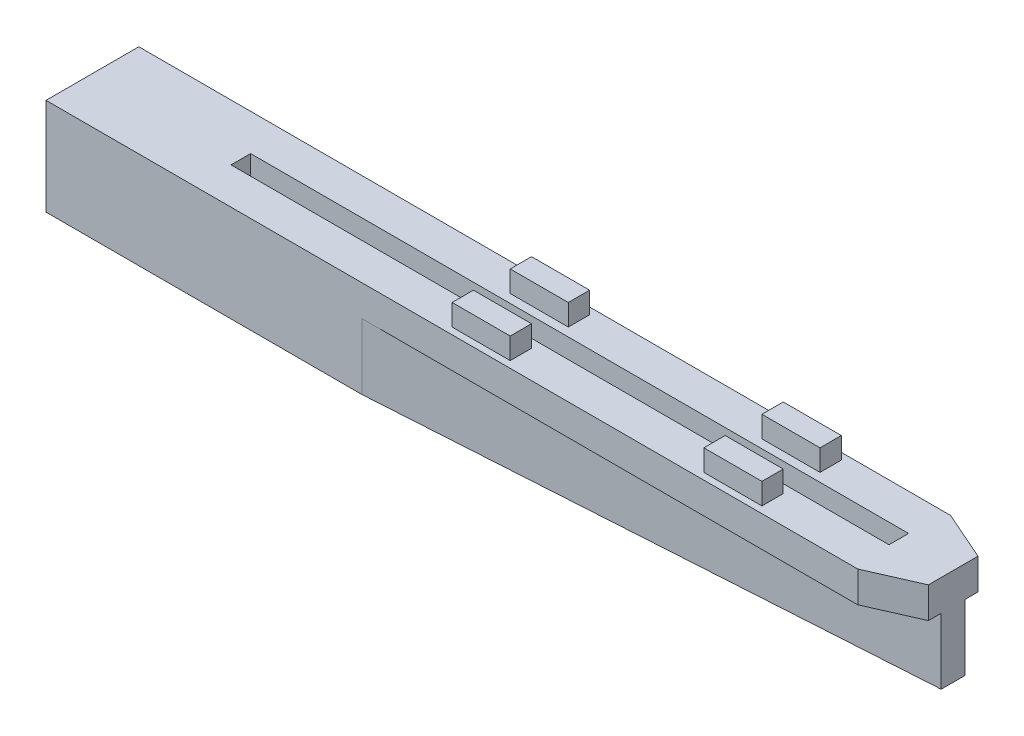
ISO-10303-21;
HEADER;
FILE_DESCRIPTION(('STEP AP214'),'2;1');
FILE_NAME('part.step','',(''),(''),'','','');
FILE_SCHEMA(('AUTOMOTIVE_DESIGN { 1 0 10303 214 1 1 1 1 }'));
ENDSEC;
DATA;
#1=APPLICATION_CONTEXT('core data for automotive mechanical design processes');
#2=APPLICATION_PROTOCOL_DEFINITION('international standard','automotive_design',2000,#1);
#3=PRODUCT_CONTEXT('',#1,'mechanical');
#4=PRODUCT('Part','Part','',(#3));
#5=PRODUCT_RELATED_PRODUCT_CATEGORY('part','',(#4));
#6=PRODUCT_DEFINITION_FORMATION('','',#4);
#7=PRODUCT_DEFINITION_CONTEXT('part definition',#1,'design');
#8=PRODUCT_DEFINITION('design','',#6,#7);
#9=PRODUCT_DEFINITION_SHAPE('','',#8);
#10=(LENGTH_UNIT() NAMED_UNIT(*) SI_UNIT(.MILLI.,.METRE.));
#11=(NAMED_UNIT(*) PLANE_ANGLE_UNIT() SI_UNIT($,.RADIAN.));
#12=(NAMED_UNIT(*) SI_UNIT($,.STERADIAN.) SOLID_ANGLE_UNIT());
#13=UNCERTAINTY_MEASURE_WITH_UNIT(LENGTH_MEASURE(1.E-05),#10,'distance_accuracy_value','');
#14=(GEOMETRIC_REPRESENTATION_CONTEXT(3) GLOBAL_UNCERTAINTY_ASSIGNED_CONTEXT((#13)) GLOBAL_UNIT_ASSIGNED_CONTEXT((#10,
#11,#12)) REPRESENTATION_CONTEXT('',''));
#15=CARTESIAN_POINT('',(0.,0.,0.));
#16=DIRECTION('',(0.,0.,1.));
#17=DIRECTION('',(1.,0.,0.));
#18=AXIS2_PLACEMENT_3D('',#15,#16,#17);
#19=CARTESIAN_POINT('',(0.,5.,0.));
#20=DIRECTION('',(0.,1.,0.));
#21=DIRECTION('',(0.,0.,1.));
#22=AXIS2_PLACEMENT_3D('',#19,#20,#21);
#23=PLANE('',#22);
#24=DIRECTION('',(0.,0.,-1.));
#25=VECTOR('',#24,1.);
#26=CARTESIAN_POINT('',(139.041754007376,5.,0.));
#27=LINE('',#26,#25);
#28=CARTESIAN_POINT('',(139.041754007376,5.00000000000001,-3.00868074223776));
#29=VERTEX_POINT('',#28);
#30=CARTESIAN_POINT('',(139.041754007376,5.00000000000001,-8.06656143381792));
#31=VERTEX_POINT('',#30);
#32=EDGE_CURVE('E445',#29,#31,#27,.T.);
#33=ORIENTED_EDGE('',*,*,#32,.F.);
#34=DIRECTION('',(1.,0.,0.));
#35=VECTOR('',#34,1.);
#36=CARTESIAN_POINT('',(0.,5.,-3.00868074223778));
#37=LINE('',#36,#35);
#38=CARTESIAN_POINT('',(-30.8596042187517,5.,-3.00868074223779));
#39=VERTEX_POINT('',#38);
#40=EDGE_CURVE('E433',#39,#29,#37,.T.);
#41=ORIENTED_EDGE('',*,*,#40,.F.);
#42=DIRECTION('',(0.,0.,1.));
#43=VECTOR('',#42,1.);
#44=CARTESIAN_POINT('',(-30.8596042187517,5.,0.));
#45=LINE('',#44,#43);
#46=CARTESIAN_POINT('',(-30.8596042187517,5.00000000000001,-8.06656143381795));
#47=VERTEX_POINT('',#46);
#48=EDGE_CURVE('E440',#47,#39,#45,.T.);
#49=ORIENTED_EDGE('',*,*,#48,.F.);
#50=DIRECTION('',(-1.,0.,0.));
#51=VECTOR('',#50,1.);
#52=CARTESIAN_POINT('',(0.,5.,-8.06656143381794));
#53=LINE('',#52,#51);
#54=EDGE_CURVE('E443',#31,#47,#53,.T.);
#55=ORIENTED_EDGE('',*,*,#54,.F.);
#56=EDGE_LOOP('',(#33,#41,#49,#55));
#57=FACE_BOUND('',#56,.T.);
#58=DIRECTION('',(0.,0.,1.));
#59=VECTOR('',#58,1.);
#60=CARTESIAN_POINT('',(-69.1807806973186,5.,-17.5199527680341));
#61=LINE('',#60,#59);
#62=CARTESIAN_POINT('',(-69.1807806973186,5.,-17.5199527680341));
#63=VERTEX_POINT('',#62);
#64=CARTESIAN_POINT('',(-69.1807806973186,5.,6.44471059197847));
#65=VERTEX_POINT('',#64);
#66=EDGE_CURVE('E447',#63,#65,#61,.T.);
#67=ORIENTED_EDGE('',*,*,#66,.T.);
#68=DIRECTION('',(1.,0.,0.));
#69=VECTOR('',#68,1.);
#70=CARTESIAN_POINT('',(-69.1807806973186,5.,6.44471059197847));
#71=LINE('',#70,#69);
#72=CARTESIAN_POINT('',(140.433207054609,5.,6.44471059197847));
#73=VERTEX_POINT('',#72);
#74=EDGE_CURVE('E450',#65,#73,#71,.T.);
#75=ORIENTED_EDGE('',*,*,#74,.T.);
#76=DIRECTION('',(0.915136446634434,0.,-0.403144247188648));
#77=VECTOR('',#76,1.);
#78=CARTESIAN_POINT('',(140.433207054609,5.,6.44471059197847));
#79=LINE('',#78,#77);
#80=CARTESIAN_POINT('',(153.094163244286,5.,0.867190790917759));
#81=VERTEX_POINT('',#80);
#82=EDGE_CURVE('E452',#73,#81,#79,.T.);
#83=ORIENTED_EDGE('',*,*,#82,.T.);
#84=DIRECTION('',(0.,0.,-1.));
#85=VECTOR('',#84,1.);
#86=CARTESIAN_POINT('',(153.094163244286,5.,-11.9424329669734));
#87=LINE('',#86,#85);
#88=CARTESIAN_POINT('',(153.094163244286,5.,-11.9424329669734));
#89=VERTEX_POINT('',#88);
#90=EDGE_CURVE('E454',#81,#89,#87,.T.);
#91=ORIENTED_EDGE('',*,*,#90,.T.);
#92=DIRECTION('',(-0.915136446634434,0.,-0.403144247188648));
#93=VECTOR('',#92,1.);
#94=CARTESIAN_POINT('',(140.433207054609,5.,-17.5199527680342));
#95=LINE('',#94,#93);
#96=CARTESIAN_POINT('',(140.433207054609,5.,-17.5199527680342));
#97=VERTEX_POINT('',#96);
#98=EDGE_CURVE('E456',#89,#97,#95,.T.);
#99=ORIENTED_EDGE('',*,*,#98,.T.);
#100=DIRECTION('',(-1.,0.,0.));
#101=VECTOR('',#100,1.);
#102=CARTESIAN_POINT('',(-69.1807806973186,5.,-17.5199527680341));
#103=LINE('',#102,#101);
#104=EDGE_CURVE('E458',#97,#63,#103,.T.);
#105=ORIENTED_EDGE('',*,*,#104,.T.);
#106=EDGE_LOOP('',(#67,#75,#83,#91,#99,#105));
#107=FACE_BOUND('',#106,.T.);
#108=DIRECTION('',(0.,0.,1.));
#109=VECTOR('',#108,1.);
#110=CARTESIAN_POINT('',(98.9561385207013,5.,-15.7876210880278));
#111=LINE('',#110,#109);
#112=CARTESIAN_POINT('',(98.9561385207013,5.,-15.7876210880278));
#113=VERTEX_POINT('',#112);
#114=CARTESIAN_POINT('',(98.9561385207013,5.,-10.2876210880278));
#115=VERTEX_POINT('',#114);
#116=EDGE_CURVE('E391',#113,#115,#111,.T.);
#117=ORIENTED_EDGE('',*,*,#116,.F.);
#118=DIRECTION('',(-1.,0.,0.));
#119=VECTOR('',#118,1.);
#120=CARTESIAN_POINT('',(98.9561385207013,5.,-15.7876210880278));
#121=LINE('',#120,#119);
#122=CARTESIAN_POINT('',(113.956138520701,5.,-15.7876210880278));
#123=VERTEX_POINT('',#122);
#124=EDGE_CURVE('E418',#123,#113,#121,.T.);
#125=ORIENTED_EDGE('',*,*,#124,.F.);
#126=DIRECTION('',(0.,0.,-1.));
#127=VECTOR('',#126,1.);
#128=CARTESIAN_POINT('',(113.956138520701,5.,-15.7876210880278));
#129=LINE('',#128,#127);
#130=CARTESIAN_POINT('',(113.956138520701,5.,-10.2876210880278));
#131=VERTEX_POINT('',#130);
#132=EDGE_CURVE('E415',#131,#123,#129,.T.);
#133=ORIENTED_EDGE('',*,*,#132,.F.);
#134=DIRECTION('',(1.,0.,0.));
#135=VECTOR('',#134,1.);
#136=CARTESIAN_POINT('',(98.9561385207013,5.,-10.2876210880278));
#137=LINE('',#136,#135);
#138=EDGE_CURVE('E412',#115,#131,#137,.T.);
#139=ORIENTED_EDGE('',*,*,#138,.F.);
#140=EDGE_LOOP('',(#117,#125,#133,#139));
#141=FACE_BOUND('',#140,.T.);
#142=DIRECTION('',(1.,0.,0.));
#143=VECTOR('',#142,1.);
#144=CARTESIAN_POINT('',(98.9561385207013,5.,4.71237891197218));
#145=LINE('',#144,#143);
#146=CARTESIAN_POINT('',(98.9561385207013,5.,4.71237891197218));
#147=VERTEX_POINT('',#146);
#148=CARTESIAN_POINT('',(113.956138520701,5.,4.71237891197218));
#149=VERTEX_POINT('',#148);
#150=EDGE_CURVE('E388',#147,#149,#145,.T.);
#151=ORIENTED_EDGE('',*,*,#150,.F.);
#152=DIRECTION('',(0.,0.,1.));
#153=VECTOR('',#152,1.);
#154=CARTESIAN_POINT('',(98.9561385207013,5.,4.71237891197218));
#155=LINE('',#154,#153);
#156=CARTESIAN_POINT('',(98.9561385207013,5.,-0.787621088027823));
#157=VERTEX_POINT('',#156);
#158=EDGE_CURVE('E380',#157,#147,#155,.T.);
#159=ORIENTED_EDGE('',*,*,#158,.F.);
#160=DIRECTION('',(-1.,0.,0.));
#161=VECTOR('',#160,1.);
#162=CARTESIAN_POINT('',(98.9561385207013,5.,-0.787621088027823));
#163=LINE('',#162,#161);
#164=CARTESIAN_POINT('',(113.956138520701,5.,-0.787621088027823));
#165=VERTEX_POINT('',#164);
#166=EDGE_CURVE('E382',#165,#157,#163,.T.);
#167=ORIENTED_EDGE('',*,*,#166,.F.);
#168=DIRECTION('',(0.,0.,-1.));
#169=VECTOR('',#168,1.);
#170=CARTESIAN_POINT('',(113.956138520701,5.,4.71237891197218));
#171=LINE('',#170,#169);
#172=EDGE_CURVE('E385',#149,#165,#171,.T.);
#173=ORIENTED_EDGE('',*,*,#172,.F.);
#174=EDGE_LOOP('',(#151,#159,#167,#173));
#175=FACE_BOUND('',#174,.T.);
#176=DIRECTION('',(1.,0.,0.));
#177=VECTOR('',#176,1.);
#178=CARTESIAN_POINT('',(33.9561385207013,5.,4.71237891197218));
#179=LINE('',#178,#177);
#180=CARTESIAN_POINT('',(33.9561385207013,5.,4.71237891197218));
#181=VERTEX_POINT('',#180);
#182=CARTESIAN_POINT('',(48.9561385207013,5.,4.71237891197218));
#183=VERTEX_POINT('',#182);
#184=EDGE_CURVE('E356',#181,#183,#179,.T.);
#185=ORIENTED_EDGE('',*,*,#184,.F.);
#186=DIRECTION('',(0.,0.,1.));
#187=VECTOR('',#186,1.);
#188=CARTESIAN_POINT('',(33.9561385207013,5.,4.71237891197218));
#189=LINE('',#188,#187);
#190=CARTESIAN_POINT('',(33.9561385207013,5.,-0.787621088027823));
#191=VERTEX_POINT('',#190);
#192=EDGE_CURVE('E348',#191,#181,#189,.T.);
#193=ORIENTED_EDGE('',*,*,#192,.F.);
#194=DIRECTION('',(-1.,0.,0.));
#195=VECTOR('',#194,1.);
#196=CARTESIAN_POINT('',(33.9561385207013,5.,-0.787621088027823));
#197=LINE('',#196,#195);
#198=CARTESIAN_POINT('',(48.9561385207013,5.,-0.787621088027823));
#199=VERTEX_POINT('',#198);
#200=EDGE_CURVE('E350',#199,#191,#197,.T.);
#201=ORIENTED_EDGE('',*,*,#200,.F.);
#202=DIRECTION('',(0.,0.,-1.));
#203=VECTOR('',#202,1.);
#204=CARTESIAN_POINT('',(48.9561385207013,5.,4.71237891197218));
#205=LINE('',#204,#203);
#206=EDGE_CURVE('E353',#183,#199,#205,.T.);
#207=ORIENTED_EDGE('',*,*,#206,.F.);
#208=EDGE_LOOP('',(#185,#193,#201,#207));
#209=FACE_BOUND('',#208,.T.);
#210=DIRECTION('',(-1.,0.,0.));
#211=VECTOR('',#210,1.);
#212=CARTESIAN_POINT('',(33.9561385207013,5.,-15.7876210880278));
#213=LINE('',#212,#211);
#214=CARTESIAN_POINT('',(48.9561385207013,5.,-15.7876210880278));
#215=VERTEX_POINT('',#214);
#216=CARTESIAN_POINT('',(33.9561385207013,5.,-15.7876210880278));
#217=VERTEX_POINT('',#216);
#218=EDGE_CURVE('E324',#215,#217,#213,.T.);
#219=ORIENTED_EDGE('',*,*,#218,.F.);
#220=DIRECTION('',(0.,0.,-1.));
#221=VECTOR('',#220,1.);
#222=CARTESIAN_POINT('',(48.9561385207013,5.,-15.7876210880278));
#223=LINE('',#222,#221);
#224=CARTESIAN_POINT('',(48.9561385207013,5.,-10.2876210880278));
#225=VERTEX_POINT('',#224);
#226=EDGE_CURVE('E316',#225,#215,#223,.T.);
#227=ORIENTED_EDGE('',*,*,#226,.F.);
#228=DIRECTION('',(1.,0.,0.));
#229=VECTOR('',#228,1.);
#230=CARTESIAN_POINT('',(33.9561385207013,5.,-10.2876210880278));
#231=LINE('',#230,#229);
#232=CARTESIAN_POINT('',(33.9561385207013,5.,-10.2876210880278));
#233=VERTEX_POINT('',#232);
#234=EDGE_CURVE('E318',#233,#225,#231,.T.);
#235=ORIENTED_EDGE('',*,*,#234,.F.);
#236=DIRECTION('',(0.,0.,1.));
#237=VECTOR('',#236,1.);
#238=CARTESIAN_POINT('',(33.9561385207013,5.,-15.7876210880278));
#239=LINE('',#238,#237);
#240=EDGE_CURVE('E321',#217,#233,#239,.T.);
#241=ORIENTED_EDGE('',*,*,#240,.F.);
#242=EDGE_LOOP('',(#219,#227,#235,#241));
#243=FACE_BOUND('',#242,.T.);
#244=ADVANCED_FACE('F39',(#57,#107,#141,#175,#209,#243),#23,.T.);
#245=CARTESIAN_POINT('',(-69.1807806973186,5.,-17.5199527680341));
#246=DIRECTION('',(1.,0.,0.));
#247=DIRECTION('',(0.,0.,-1.));
#248=AXIS2_PLACEMENT_3D('',#245,#246,#247);
#249=PLANE('',#248);
#250=DIRECTION('',(0.,-1.,0.));
#251=VECTOR('',#250,1.);
#252=CARTESIAN_POINT('',(-69.1807806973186,5.,-17.5199527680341));
#253=LINE('',#252,#251);
#254=CARTESIAN_POINT('',(-69.1807806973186,-20.,-17.5199527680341));
#255=VERTEX_POINT('',#254);
#256=EDGE_CURVE('E460',#63,#255,#253,.T.);
#257=ORIENTED_EDGE('',*,*,#256,.T.);
#258=DIRECTION('',(0.,0.,-1.));
#259=VECTOR('',#258,1.);
#260=CARTESIAN_POINT('',(-69.1807806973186,-20.,0.));
#261=LINE('',#260,#259);
#262=CARTESIAN_POINT('',(-69.1807806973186,-20.,6.44471059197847));
#263=VERTEX_POINT('',#262);
#264=EDGE_CURVE('E282',#263,#255,#261,.T.);
#265=ORIENTED_EDGE('',*,*,#264,.F.);
#266=DIRECTION('',(0.,-1.,0.));
#267=VECTOR('',#266,1.);
#268=CARTESIAN_POINT('',(-69.1807806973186,5.,6.44471059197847));
#269=LINE('',#268,#267);
#270=EDGE_CURVE('E11',#65,#263,#269,.T.);
#271=ORIENTED_EDGE('',*,*,#270,.F.);
#272=ORIENTED_EDGE('',*,*,#66,.F.);
#273=EDGE_LOOP('',(#257,#265,#271,#272));
#274=FACE_BOUND('',#273,.T.);
#275=ADVANCED_FACE('F41',(#274),#249,.F.);
#276=CARTESIAN_POINT('',(-69.1807806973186,5.,6.44471059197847));
#277=DIRECTION('',(0.,0.,-1.));
#278=DIRECTION('',(-1.,0.,0.));
#279=AXIS2_PLACEMENT_3D('',#276,#277,#278);
#280=PLANE('',#279);
#281=DIRECTION('',(-1.,0.,0.));
#282=VECTOR('',#281,1.);
#283=CARTESIAN_POINT('',(0.,-20.,6.44471059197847));
#284=LINE('',#283,#282);
#285=CARTESIAN_POINT('',(12.387057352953,-20.,6.44471059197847));
#286=VERTEX_POINT('',#285);
#287=EDGE_CURVE('E264',#286,#263,#284,.T.);
#288=ORIENTED_EDGE('',*,*,#287,.F.);
#289=DIRECTION('',(0.,-1.,0.));
#290=VECTOR('',#289,1.);
#291=CARTESIAN_POINT('',(12.387057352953,-3.,6.44471059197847));
#292=LINE('',#291,#290);
#293=CARTESIAN_POINT('',(12.387057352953,-3.,6.44471059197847));
#294=VERTEX_POINT('',#293);
#295=EDGE_CURVE('E62',#294,#286,#292,.T.);
#296=ORIENTED_EDGE('',*,*,#295,.F.);
#297=DIRECTION('',(-1.,0.,0.));
#298=VECTOR('',#297,1.);
#299=CARTESIAN_POINT('',(140.433207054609,-3.,6.44471059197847));
#300=LINE('',#299,#298);
#301=CARTESIAN_POINT('',(140.433207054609,-3.,6.44471059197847));
#302=VERTEX_POINT('',#301);
#303=EDGE_CURVE('E269',#302,#294,#300,.T.);
#304=ORIENTED_EDGE('',*,*,#303,.F.);
#305=DIRECTION('',(0.,-1.,0.));
#306=VECTOR('',#305,1.);
#307=CARTESIAN_POINT('',(140.433207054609,5.,6.44471059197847));
#308=LINE('',#307,#306);
#309=EDGE_CURVE('E47',#73,#302,#308,.T.);
#310=ORIENTED_EDGE('',*,*,#309,.F.);
#311=ORIENTED_EDGE('',*,*,#74,.F.);
#312=ORIENTED_EDGE('',*,*,#270,.T.);
#313=EDGE_LOOP('',(#288,#296,#304,#310,#311,#312));
#314=FACE_BOUND('',#313,.T.);
#315=ADVANCED_FACE('F478',(#314),#280,.F.);
#316=CARTESIAN_POINT('',(140.433207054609,5.,6.44471059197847));
#317=DIRECTION('',(-0.403144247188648,0.,-0.915136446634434));
#318=DIRECTION('',(-0.915136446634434,0.,0.403144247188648));
#319=AXIS2_PLACEMENT_3D('',#316,#317,#318);
#320=PLANE('',#319);
#321=ORIENTED_EDGE('',*,*,#309,.T.);
#322=DIRECTION('',(-0.915136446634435,0.,0.403144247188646));
#323=VECTOR('',#322,1.);
#324=CARTESIAN_POINT('',(153.094163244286,-3.,0.867190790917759));
#325=LINE('',#324,#323);
#326=CARTESIAN_POINT('',(153.094163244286,-3.,0.867190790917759));
#327=VERTEX_POINT('',#326);
#328=EDGE_CURVE('E275',#327,#302,#325,.T.);
#329=ORIENTED_EDGE('',*,*,#328,.F.);
#330=DIRECTION('',(0.,-1.,0.));
#331=VECTOR('',#330,1.);
#332=CARTESIAN_POINT('',(153.094163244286,5.,0.867190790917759));
#333=LINE('',#332,#331);
#334=EDGE_CURVE('E466',#81,#327,#333,.T.);
#335=ORIENTED_EDGE('',*,*,#334,.F.);
#336=ORIENTED_EDGE('',*,*,#82,.F.);
#337=EDGE_LOOP('',(#321,#329,#335,#336));
#338=FACE_BOUND('',#337,.T.);
#339=ADVANCED_FACE('F473',(#338),#320,.F.);
#340=CARTESIAN_POINT('',(153.094163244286,5.,-11.9424329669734));
#341=DIRECTION('',(-1.,0.,0.));
#342=DIRECTION('',(0.,0.,1.));
#343=AXIS2_PLACEMENT_3D('',#340,#341,#342);
#344=PLANE('',#343);
#345=DIRECTION('',(0.,0.,1.));
#346=VECTOR('',#345,1.);
#347=CARTESIAN_POINT('',(153.094163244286,-20.,0.));
#348=LINE('',#347,#346);
#349=CARTESIAN_POINT('',(153.094163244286,-20.,-8.63762108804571));
#350=VERTEX_POINT('',#349);
#351=CARTESIAN_POINT('',(153.094163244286,-20.,-2.43762108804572));
#352=VERTEX_POINT('',#351);
#353=EDGE_CURVE('E287',#350,#352,#348,.T.);
#354=ORIENTED_EDGE('',*,*,#353,.F.);
#355=DIRECTION('',(0.,-1.,0.));
#356=VECTOR('',#355,1.);
#357=CARTESIAN_POINT('',(153.094163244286,-3.,-8.63762108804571));
#358=LINE('',#357,#356);
#359=CARTESIAN_POINT('',(153.094163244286,-3.,-8.63762108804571));
#360=VERTEX_POINT('',#359);
#361=EDGE_CURVE('E54',#360,#350,#358,.T.);
#362=ORIENTED_EDGE('',*,*,#361,.F.);
#363=DIRECTION('',(0.,0.,1.));
#364=VECTOR('',#363,1.);
#365=CARTESIAN_POINT('',(153.094163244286,-3.,-11.9424329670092));
#366=LINE('',#365,#364);
#367=CARTESIAN_POINT('',(153.094163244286,-3.,-11.9424329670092));
#368=VERTEX_POINT('',#367);
#369=EDGE_CURVE('E244',#368,#360,#366,.T.);
#370=ORIENTED_EDGE('',*,*,#369,.F.);
#371=DIRECTION('',(0.,-1.,0.));
#372=VECTOR('',#371,1.);
#373=CARTESIAN_POINT('',(153.094163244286,5.,-11.9424329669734));
#374=LINE('',#373,#372);
#375=EDGE_CURVE('E463',#89,#368,#374,.T.);
#376=ORIENTED_EDGE('',*,*,#375,.F.);
#377=ORIENTED_EDGE('',*,*,#90,.F.);
#378=ORIENTED_EDGE('',*,*,#334,.T.);
#379=DIRECTION('',(0.,0.,1.));
#380=VECTOR('',#379,1.);
#381=CARTESIAN_POINT('',(153.094163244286,-3.,-2.43762108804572));
#382=LINE('',#381,#380);
#383=CARTESIAN_POINT('',(153.094163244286,-3.,-2.43762108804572));
#384=VERTEX_POINT('',#383);
#385=EDGE_CURVE('E277',#384,#327,#382,.T.);
#386=ORIENTED_EDGE('',*,*,#385,.F.);
#387=DIRECTION('',(0.,-1.,0.));
#388=VECTOR('',#387,1.);
#389=CARTESIAN_POINT('',(153.094163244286,-3.,-2.43762108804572));
#390=LINE('',#389,#388);
#391=EDGE_CURVE('E266',#384,#352,#390,.T.);
#392=ORIENTED_EDGE('',*,*,#391,.T.);
#393=EDGE_LOOP('',(#354,#362,#370,#376,#377,#378,#386,#392));
#394=FACE_BOUND('',#393,.T.);
#395=ADVANCED_FACE('F484',(#394),#344,.F.);
#396=CARTESIAN_POINT('',(140.433207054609,5.,-17.5199527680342));
#397=DIRECTION('',(-0.403144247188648,0.,0.915136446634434));
#398=DIRECTION('',(0.915136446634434,0.,0.403144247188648));
#399=AXIS2_PLACEMENT_3D('',#396,#397,#398);
#400=PLANE('',#399);
#401=ORIENTED_EDGE('',*,*,#375,.T.);
#402=DIRECTION('',(0.915136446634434,0.,0.403144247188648));
#403=VECTOR('',#402,1.);
#404=CARTESIAN_POINT('',(140.433207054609,-3.,-17.5199527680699));
#405=LINE('',#404,#403);
#406=CARTESIAN_POINT('',(140.433207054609,-3.,-17.5199527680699));
#407=VERTEX_POINT('',#406);
#408=EDGE_CURVE('E257',#407,#368,#405,.T.);
#409=ORIENTED_EDGE('',*,*,#408,.F.);
#410=DIRECTION('',(0.,-1.,0.));
#411=VECTOR('',#410,1.);
#412=CARTESIAN_POINT('',(140.433207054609,5.,-17.5199527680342));
#413=LINE('',#412,#411);
#414=EDGE_CURVE('E256',#97,#407,#413,.T.);
#415=ORIENTED_EDGE('',*,*,#414,.F.);
#416=ORIENTED_EDGE('',*,*,#98,.F.);
#417=EDGE_LOOP('',(#401,#409,#415,#416));
#418=FACE_BOUND('',#417,.T.);
#419=ADVANCED_FACE('F522',(#418),#400,.F.);
#420=CARTESIAN_POINT('',(-69.1807806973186,5.,-17.5199527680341));
#421=DIRECTION('',(0.,0.,1.));
#422=DIRECTION('',(1.,0.,0.));
#423=AXIS2_PLACEMENT_3D('',#420,#421,#422);
#424=PLANE('',#423);
#425=DIRECTION('',(1.,0.,-2.99104853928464E-13));
#426=VECTOR('',#425,1.);
#427=CARTESIAN_POINT('',(12.387057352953,-3.,-17.5199527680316));
#428=LINE('',#427,#426);
#429=CARTESIAN_POINT('',(12.387057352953,-3.,-17.5199527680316));
#430=VERTEX_POINT('',#429);
#431=EDGE_CURVE('E248',#430,#407,#428,.T.);
#432=ORIENTED_EDGE('',*,*,#431,.F.);
#433=DIRECTION('',(0.,-1.,0.));
#434=VECTOR('',#433,1.);
#435=CARTESIAN_POINT('',(12.387057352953,-3.,-17.5199527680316));
#436=LINE('',#435,#434);
#437=CARTESIAN_POINT('',(12.387057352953,-20.,-17.5199527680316));
#438=VERTEX_POINT('',#437);
#439=EDGE_CURVE('E234',#430,#438,#436,.T.);
#440=ORIENTED_EDGE('',*,*,#439,.T.);
#441=DIRECTION('',(1.,0.,0.));
#442=VECTOR('',#441,1.);
#443=CARTESIAN_POINT('',(0.,-20.,-17.5199527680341));
#444=LINE('',#443,#442);
#445=EDGE_CURVE('E285',#255,#438,#444,.T.);
#446=ORIENTED_EDGE('',*,*,#445,.F.);
#447=ORIENTED_EDGE('',*,*,#256,.F.);
#448=ORIENTED_EDGE('',*,*,#104,.F.);
#449=ORIENTED_EDGE('',*,*,#414,.T.);
#450=EDGE_LOOP('',(#432,#440,#446,#447,#448,#449));
#451=FACE_BOUND('',#450,.T.);
#452=ADVANCED_FACE('F253',(#451),#424,.F.);
#453=CARTESIAN_POINT('',(139.041754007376,26.,-8.06656143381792));
#454=DIRECTION('',(1.,0.,0.));
#455=DIRECTION('',(0.,0.,-1.));
#456=AXIS2_PLACEMENT_3D('',#453,#454,#455);
#457=PLANE('',#456);
#458=ORIENTED_EDGE('',*,*,#32,.T.);
#459=DIRECTION('',(0.,-1.,0.));
#460=VECTOR('',#459,1.);
#461=CARTESIAN_POINT('',(139.041754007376,26.,-8.06656143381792));
#462=LINE('',#461,#460);
#463=CARTESIAN_POINT('',(139.041754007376,-20.,-8.06656143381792));
#464=VERTEX_POINT('',#463);
#465=EDGE_CURVE('E431',#31,#464,#462,.T.);
#466=ORIENTED_EDGE('',*,*,#465,.T.);
#467=DIRECTION('',(0.,0.,-1.));
#468=VECTOR('',#467,1.);
#469=CARTESIAN_POINT('',(139.041754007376,-20.,0.));
#470=LINE('',#469,#468);
#471=CARTESIAN_POINT('',(139.041754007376,-20.,-3.00868074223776));
#472=VERTEX_POINT('',#471);
#473=EDGE_CURVE('E296',#472,#464,#470,.T.);
#474=ORIENTED_EDGE('',*,*,#473,.F.);
#475=DIRECTION('',(0.,-1.,0.));
#476=VECTOR('',#475,1.);
#477=CARTESIAN_POINT('',(139.041754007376,26.,-3.00868074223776));
#478=LINE('',#477,#476);
#479=EDGE_CURVE('E409',#29,#472,#478,.T.);
#480=ORIENTED_EDGE('',*,*,#479,.F.);
#481=EDGE_LOOP('',(#458,#466,#474,#480));
#482=FACE_BOUND('',#481,.T.);
#483=ADVANCED_FACE('F518',(#482),#457,.F.);
#484=CARTESIAN_POINT('',(139.041754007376,26.,-8.06656143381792));
#485=DIRECTION('',(0.,0.,-1.));
#486=DIRECTION('',(-1.,0.,0.));
#487=AXIS2_PLACEMENT_3D('',#484,#485,#486);
#488=PLANE('',#487);
#489=ORIENTED_EDGE('',*,*,#54,.T.);
#490=DIRECTION('',(0.,-1.,0.));
#491=VECTOR('',#490,1.);
#492=CARTESIAN_POINT('',(-30.8596042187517,26.,-8.06656143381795));
#493=LINE('',#492,#491);
#494=CARTESIAN_POINT('',(-30.8596042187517,-20.,-8.06656143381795));
#495=VERTEX_POINT('',#494);
#496=EDGE_CURVE('E434',#47,#495,#493,.T.);
#497=ORIENTED_EDGE('',*,*,#496,.T.);
#498=DIRECTION('',(-1.,0.,0.));
#499=VECTOR('',#498,1.);
#500=CARTESIAN_POINT('',(0.,-20.,-8.06656143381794));
#501=LINE('',#500,#499);
#502=EDGE_CURVE('E299',#464,#495,#501,.T.);
#503=ORIENTED_EDGE('',*,*,#502,.F.);
#504=ORIENTED_EDGE('',*,*,#465,.F.);
#505=EDGE_LOOP('',(#489,#497,#503,#504));
#506=FACE_BOUND('',#505,.T.);
#507=ADVANCED_FACE('F558',(#506),#488,.F.);
#508=CARTESIAN_POINT('',(-30.8596042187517,26.,-8.06656143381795));
#509=DIRECTION('',(-1.,0.,0.));
#510=DIRECTION('',(0.,0.,1.));
#511=AXIS2_PLACEMENT_3D('',#508,#509,#510);
#512=PLANE('',#511);
#513=ORIENTED_EDGE('',*,*,#48,.T.);
#514=DIRECTION('',(0.,-1.,0.));
#515=VECTOR('',#514,1.);
#516=CARTESIAN_POINT('',(-30.8596042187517,26.,-3.00868074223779));
#517=LINE('',#516,#515);
#518=CARTESIAN_POINT('',(-30.8596042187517,-20.,-3.00868074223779));
#519=VERTEX_POINT('',#518);
#520=EDGE_CURVE('E436',#39,#519,#517,.T.);
#521=ORIENTED_EDGE('',*,*,#520,.T.);
#522=DIRECTION('',(0.,0.,1.));
#523=VECTOR('',#522,1.);
#524=CARTESIAN_POINT('',(-30.8596042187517,-20.,0.));
#525=LINE('',#524,#523);
#526=EDGE_CURVE('E290',#495,#519,#525,.T.);
#527=ORIENTED_EDGE('',*,*,#526,.F.);
#528=ORIENTED_EDGE('',*,*,#496,.F.);
#529=EDGE_LOOP('',(#513,#521,#527,#528));
#530=FACE_BOUND('',#529,.T.);
#531=ADVANCED_FACE('F565',(#530),#512,.F.);
#532=CARTESIAN_POINT('',(139.041754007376,26.,-3.00868074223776));
#533=DIRECTION('',(0.,0.,1.));
#534=DIRECTION('',(1.,0.,0.));
#535=AXIS2_PLACEMENT_3D('',#532,#533,#534);
#536=PLANE('',#535);
#537=ORIENTED_EDGE('',*,*,#40,.T.);
#538=ORIENTED_EDGE('',*,*,#479,.T.);
#539=DIRECTION('',(1.,0.,0.));
#540=VECTOR('',#539,1.);
#541=CARTESIAN_POINT('',(0.,-20.,-3.00868074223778));
#542=LINE('',#541,#540);
#543=EDGE_CURVE('E293',#519,#472,#542,.T.);
#544=ORIENTED_EDGE('',*,*,#543,.F.);
#545=ORIENTED_EDGE('',*,*,#520,.F.);
#546=EDGE_LOOP('',(#537,#538,#544,#545));
#547=FACE_BOUND('',#546,.T.);
#548=ADVANCED_FACE('F573',(#547),#536,.F.);
#549=CARTESIAN_POINT('',(98.9561385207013,26.4765453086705,-15.7876210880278));
#550=DIRECTION('',(0.,0.,1.));
#551=DIRECTION('',(1.,0.,0.));
#552=AXIS2_PLACEMENT_3D('',#549,#550,#551);
#553=PLANE('',#552);
#554=DIRECTION('',(0.,-1.,0.));
#555=VECTOR('',#554,1.);
#556=CARTESIAN_POINT('',(98.9561385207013,26.4765453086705,-15.7876210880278));
#557=LINE('',#556,#555);
#558=CARTESIAN_POINT('',(98.9561385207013,10.5,-15.7876210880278));
#559=VERTEX_POINT('',#558);
#560=EDGE_CURVE('E420',#559,#113,#557,.T.);
#561=ORIENTED_EDGE('',*,*,#560,.F.);
#562=DIRECTION('',(1.,0.,0.));
#563=VECTOR('',#562,1.);
#564=CARTESIAN_POINT('',(98.9561385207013,10.5,-15.7876210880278));
#565=LINE('',#564,#563);
#566=CARTESIAN_POINT('',(113.956138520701,10.5,-15.7876210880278));
#567=VERTEX_POINT('',#566);
#568=EDGE_CURVE('E403',#559,#567,#565,.T.);
#569=ORIENTED_EDGE('',*,*,#568,.T.);
#570=DIRECTION('',(0.,-1.,0.));
#571=VECTOR('',#570,1.);
#572=CARTESIAN_POINT('',(113.956138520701,26.4765453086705,-15.7876210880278));
#573=LINE('',#572,#571);
#574=EDGE_CURVE('E423',#567,#123,#573,.T.);
#575=ORIENTED_EDGE('',*,*,#574,.T.);
#576=ORIENTED_EDGE('',*,*,#124,.T.);
#577=EDGE_LOOP('',(#561,#569,#575,#576));
#578=FACE_BOUND('',#577,.T.);
#579=ADVANCED_FACE('F580',(#578),#553,.F.);
#580=CARTESIAN_POINT('',(113.956138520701,26.4765453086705,-15.7876210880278));
#581=DIRECTION('',(-1.,0.,0.));
#582=DIRECTION('',(0.,0.,1.));
#583=AXIS2_PLACEMENT_3D('',#580,#581,#582);
#584=PLANE('',#583);
#585=ORIENTED_EDGE('',*,*,#574,.F.);
#586=DIRECTION('',(0.,0.,1.));
#587=VECTOR('',#586,1.);
#588=CARTESIAN_POINT('',(113.956138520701,10.5,-15.7876210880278));
#589=LINE('',#588,#587);
#590=CARTESIAN_POINT('',(113.956138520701,10.5,-10.2876210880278));
#591=VERTEX_POINT('',#590);
#592=EDGE_CURVE('E399',#567,#591,#589,.T.);
#593=ORIENTED_EDGE('',*,*,#592,.T.);
#594=DIRECTION('',(0.,-1.,0.));
#595=VECTOR('',#594,1.);
#596=CARTESIAN_POINT('',(113.956138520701,26.4765453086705,-10.2876210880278));
#597=LINE('',#596,#595);
#598=EDGE_CURVE('E425',#591,#131,#597,.T.);
#599=ORIENTED_EDGE('',*,*,#598,.T.);
#600=ORIENTED_EDGE('',*,*,#132,.T.);
#601=EDGE_LOOP('',(#585,#593,#599,#600));
#602=FACE_BOUND('',#601,.T.);
#603=ADVANCED_FACE('F587',(#602),#584,.F.);
#604=CARTESIAN_POINT('',(98.9561385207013,26.4765453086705,-10.2876210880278));
#605=DIRECTION('',(0.,0.,-1.));
#606=DIRECTION('',(-1.,0.,0.));
#607=AXIS2_PLACEMENT_3D('',#604,#605,#606);
#608=PLANE('',#607);
#609=ORIENTED_EDGE('',*,*,#598,.F.);
#610=DIRECTION('',(-1.,0.,0.));
#611=VECTOR('',#610,1.);
#612=CARTESIAN_POINT('',(98.9561385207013,10.5,-10.2876210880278));
#613=LINE('',#612,#611);
#614=CARTESIAN_POINT('',(98.9561385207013,10.5,-10.2876210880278));
#615=VERTEX_POINT('',#614);
#616=EDGE_CURVE('E402',#591,#615,#613,.T.);
#617=ORIENTED_EDGE('',*,*,#616,.T.);
#618=DIRECTION('',(0.,-1.,0.));
#619=VECTOR('',#618,1.);
#620=CARTESIAN_POINT('',(98.9561385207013,26.4765453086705,-10.2876210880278));
#621=LINE('',#620,#619);
#622=EDGE_CURVE('E427',#615,#115,#621,.T.);
#623=ORIENTED_EDGE('',*,*,#622,.T.);
#624=ORIENTED_EDGE('',*,*,#138,.T.);
#625=EDGE_LOOP('',(#609,#617,#623,#624));
#626=FACE_BOUND('',#625,.T.);
#627=ADVANCED_FACE('F595',(#626),#608,.F.);
#628=CARTESIAN_POINT('',(98.9561385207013,26.4765453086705,-15.7876210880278));
#629=DIRECTION('',(1.,0.,0.));
#630=DIRECTION('',(0.,0.,-1.));
#631=AXIS2_PLACEMENT_3D('',#628,#629,#630);
#632=PLANE('',#631);
#633=ORIENTED_EDGE('',*,*,#622,.F.);
#634=DIRECTION('',(0.,0.,-1.));
#635=VECTOR('',#634,1.);
#636=CARTESIAN_POINT('',(98.9561385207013,10.5,-15.7876210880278));
#637=LINE('',#636,#635);
#638=EDGE_CURVE('E406',#615,#559,#637,.T.);
#639=ORIENTED_EDGE('',*,*,#638,.T.);
#640=ORIENTED_EDGE('',*,*,#560,.T.);
#641=ORIENTED_EDGE('',*,*,#116,.T.);
#642=EDGE_LOOP('',(#633,#639,#640,#641));
#643=FACE_BOUND('',#642,.T.);
#644=ADVANCED_FACE('F603',(#643),#632,.F.);
#645=CARTESIAN_POINT('',(218.293139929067,10.5,-113.837621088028));
#646=DIRECTION('',(0.,-1.,0.));
#647=DIRECTION('',(-1.,0.,0.));
#648=AXIS2_PLACEMENT_3D('',#645,#646,#647);
#649=PLANE('',#648);
#650=ORIENTED_EDGE('',*,*,#616,.F.);
#651=ORIENTED_EDGE('',*,*,#592,.F.);
#652=ORIENTED_EDGE('',*,*,#568,.F.);
#653=ORIENTED_EDGE('',*,*,#638,.F.);
#654=EDGE_LOOP('',(#650,#651,#652,#653));
#655=FACE_BOUND('',#654,.T.);
#656=ADVANCED_FACE('F611',(#655),#649,.F.);
#657=CARTESIAN_POINT('',(98.9561385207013,26.4765453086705,4.71237891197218));
#658=DIRECTION('',(1.,0.,0.));
#659=DIRECTION('',(0.,0.,-1.));
#660=AXIS2_PLACEMENT_3D('',#657,#658,#659);
#661=PLANE('',#660);
#662=DIRECTION('',(0.,-1.,0.));
#663=VECTOR('',#662,1.);
#664=CARTESIAN_POINT('',(98.9561385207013,26.4765453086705,4.71237891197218));
#665=LINE('',#664,#663);
#666=CARTESIAN_POINT('',(98.9561385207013,10.5,4.71237891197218));
#667=VERTEX_POINT('',#666);
#668=EDGE_CURVE('E377',#667,#147,#665,.T.);
#669=ORIENTED_EDGE('',*,*,#668,.F.);
#670=DIRECTION('',(0.,0.,-1.));
#671=VECTOR('',#670,1.);
#672=CARTESIAN_POINT('',(98.9561385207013,10.5,4.71237891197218));
#673=LINE('',#672,#671);
#674=CARTESIAN_POINT('',(98.9561385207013,10.5,-0.787621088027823));
#675=VERTEX_POINT('',#674);
#676=EDGE_CURVE('E367',#667,#675,#673,.T.);
#677=ORIENTED_EDGE('',*,*,#676,.T.);
#678=DIRECTION('',(0.,-1.,0.));
#679=VECTOR('',#678,1.);
#680=CARTESIAN_POINT('',(98.9561385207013,26.4765453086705,-0.787621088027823));
#681=LINE('',#680,#679);
#682=EDGE_CURVE('E375',#675,#157,#681,.T.);
#683=ORIENTED_EDGE('',*,*,#682,.T.);
#684=ORIENTED_EDGE('',*,*,#158,.T.);
#685=EDGE_LOOP('',(#669,#677,#683,#684));
#686=FACE_BOUND('',#685,.T.);
#687=ADVANCED_FACE('F619',(#686),#661,.F.);
#688=CARTESIAN_POINT('',(98.9561385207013,26.4765453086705,-0.787621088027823));
#689=DIRECTION('',(0.,0.,1.));
#690=DIRECTION('',(1.,0.,0.));
#691=AXIS2_PLACEMENT_3D('',#688,#689,#690);
#692=PLANE('',#691);
#693=ORIENTED_EDGE('',*,*,#682,.F.);
#694=DIRECTION('',(1.,0.,0.));
#695=VECTOR('',#694,1.);
#696=CARTESIAN_POINT('',(98.9561385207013,10.5,-0.787621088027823));
#697=LINE('',#696,#695);
#698=CARTESIAN_POINT('',(113.956138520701,10.5,-0.787621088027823));
#699=VERTEX_POINT('',#698);
#700=EDGE_CURVE('E371',#675,#699,#697,.T.);
#701=ORIENTED_EDGE('',*,*,#700,.T.);
#702=DIRECTION('',(0.,-1.,0.));
#703=VECTOR('',#702,1.);
#704=CARTESIAN_POINT('',(113.956138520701,26.4765453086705,-0.787621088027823));
#705=LINE('',#704,#703);
#706=EDGE_CURVE('E373',#699,#165,#705,.T.);
#707=ORIENTED_EDGE('',*,*,#706,.T.);
#708=ORIENTED_EDGE('',*,*,#166,.T.);
#709=EDGE_LOOP('',(#693,#701,#707,#708));
#710=FACE_BOUND('',#709,.T.);
#711=ADVANCED_FACE('F627',(#710),#692,.F.);
#712=CARTESIAN_POINT('',(113.956138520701,26.4765453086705,4.71237891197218));
#713=DIRECTION('',(-1.,0.,0.));
#714=DIRECTION('',(0.,0.,1.));
#715=AXIS2_PLACEMENT_3D('',#712,#713,#714);
#716=PLANE('',#715);
#717=ORIENTED_EDGE('',*,*,#706,.F.);
#718=DIRECTION('',(0.,0.,1.));
#719=VECTOR('',#718,1.);
#720=CARTESIAN_POINT('',(113.956138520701,10.5,4.71237891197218));
#721=LINE('',#720,#719);
#722=CARTESIAN_POINT('',(113.956138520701,10.5,4.71237891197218));
#723=VERTEX_POINT('',#722);
#724=EDGE_CURVE('E394',#699,#723,#721,.T.);
#725=ORIENTED_EDGE('',*,*,#724,.T.);
#726=DIRECTION('',(0.,-1.,0.));
#727=VECTOR('',#726,1.);
#728=CARTESIAN_POINT('',(113.956138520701,26.4765453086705,4.71237891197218));
#729=LINE('',#728,#727);
#730=EDGE_CURVE('E370',#723,#149,#729,.T.);
#731=ORIENTED_EDGE('',*,*,#730,.T.);
#732=ORIENTED_EDGE('',*,*,#172,.T.);
#733=EDGE_LOOP('',(#717,#725,#731,#732));
#734=FACE_BOUND('',#733,.T.);
#735=ADVANCED_FACE('F635',(#734),#716,.F.);
#736=CARTESIAN_POINT('',(98.9561385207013,26.4765453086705,4.71237891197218));
#737=DIRECTION('',(0.,0.,-1.));
#738=DIRECTION('',(-1.,0.,0.));
#739=AXIS2_PLACEMENT_3D('',#736,#737,#738);
#740=PLANE('',#739);
#741=ORIENTED_EDGE('',*,*,#730,.F.);
#742=DIRECTION('',(-1.,0.,0.));
#743=VECTOR('',#742,1.);
#744=CARTESIAN_POINT('',(98.9561385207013,10.5,4.71237891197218));
#745=LINE('',#744,#743);
#746=EDGE_CURVE('E359',#723,#667,#745,.T.);
#747=ORIENTED_EDGE('',*,*,#746,.T.);
#748=ORIENTED_EDGE('',*,*,#668,.T.);
#749=ORIENTED_EDGE('',*,*,#150,.T.);
#750=EDGE_LOOP('',(#741,#747,#748,#749));
#751=FACE_BOUND('',#750,.T.);
#752=ADVANCED_FACE('F643',(#751),#740,.F.);
#753=CARTESIAN_POINT('',(218.293139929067,10.5,-113.837621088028));
#754=DIRECTION('',(0.,-1.,0.));
#755=DIRECTION('',(-1.,0.,0.));
#756=AXIS2_PLACEMENT_3D('',#753,#754,#755);
#757=PLANE('',#756);
#758=ORIENTED_EDGE('',*,*,#724,.F.);
#759=ORIENTED_EDGE('',*,*,#700,.F.);
#760=ORIENTED_EDGE('',*,*,#676,.F.);
#761=ORIENTED_EDGE('',*,*,#746,.F.);
#762=EDGE_LOOP('',(#758,#759,#760,#761));
#763=FACE_BOUND('',#762,.T.);
#764=ADVANCED_FACE('F651',(#763),#757,.F.);
#765=CARTESIAN_POINT('',(33.9561385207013,26.4765453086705,4.71237891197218));
#766=DIRECTION('',(1.,0.,0.));
#767=DIRECTION('',(0.,0.,-1.));
#768=AXIS2_PLACEMENT_3D('',#765,#766,#767);
#769=PLANE('',#768);
#770=DIRECTION('',(0.,-1.,0.));
#771=VECTOR('',#770,1.);
#772=CARTESIAN_POINT('',(33.9561385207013,26.4765453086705,4.71237891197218));
#773=LINE('',#772,#771);
#774=CARTESIAN_POINT('',(33.9561385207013,10.5,4.71237891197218));
#775=VERTEX_POINT('',#774);
#776=EDGE_CURVE('E345',#775,#181,#773,.T.);
#777=ORIENTED_EDGE('',*,*,#776,.F.);
#778=DIRECTION('',(0.,0.,-1.));
#779=VECTOR('',#778,1.);
#780=CARTESIAN_POINT('',(33.9561385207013,10.5,4.71237891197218));
#781=LINE('',#780,#779);
#782=CARTESIAN_POINT('',(33.9561385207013,10.5,-0.787621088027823));
#783=VERTEX_POINT('',#782);
#784=EDGE_CURVE('E335',#775,#783,#781,.T.);
#785=ORIENTED_EDGE('',*,*,#784,.T.);
#786=DIRECTION('',(0.,-1.,0.));
#787=VECTOR('',#786,1.);
#788=CARTESIAN_POINT('',(33.9561385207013,26.4765453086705,-0.787621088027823));
#789=LINE('',#788,#787);
#790=EDGE_CURVE('E343',#783,#191,#789,.T.);
#791=ORIENTED_EDGE('',*,*,#790,.T.);
#792=ORIENTED_EDGE('',*,*,#192,.T.);
#793=EDGE_LOOP('',(#777,#785,#791,#792));
#794=FACE_BOUND('',#793,.T.);
#795=ADVANCED_FACE('F659',(#794),#769,.F.);
#796=CARTESIAN_POINT('',(33.9561385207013,26.4765453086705,-0.787621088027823));
#797=DIRECTION('',(0.,0.,1.));
#798=DIRECTION('',(1.,0.,0.));
#799=AXIS2_PLACEMENT_3D('',#796,#797,#798);
#800=PLANE('',#799);
#801=ORIENTED_EDGE('',*,*,#790,.F.);
#802=DIRECTION('',(1.,0.,0.));
#803=VECTOR('',#802,1.);
#804=CARTESIAN_POINT('',(33.9561385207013,10.5,-0.787621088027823));
#805=LINE('',#804,#803);
#806=CARTESIAN_POINT('',(48.9561385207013,10.5,-0.787621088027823));
#807=VERTEX_POINT('',#806);
#808=EDGE_CURVE('E339',#783,#807,#805,.T.);
#809=ORIENTED_EDGE('',*,*,#808,.T.);
#810=DIRECTION('',(0.,-1.,0.));
#811=VECTOR('',#810,1.);
#812=CARTESIAN_POINT('',(48.9561385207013,26.4765453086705,-0.787621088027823));
#813=LINE('',#812,#811);
#814=EDGE_CURVE('E341',#807,#199,#813,.T.);
#815=ORIENTED_EDGE('',*,*,#814,.T.);
#816=ORIENTED_EDGE('',*,*,#200,.T.);
#817=EDGE_LOOP('',(#801,#809,#815,#816));
#818=FACE_BOUND('',#817,.T.);
#819=ADVANCED_FACE('F667',(#818),#800,.F.);
#820=CARTESIAN_POINT('',(48.9561385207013,26.4765453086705,4.71237891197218));
#821=DIRECTION('',(-1.,0.,0.));
#822=DIRECTION('',(0.,0.,1.));
#823=AXIS2_PLACEMENT_3D('',#820,#821,#822);
#824=PLANE('',#823);
#825=ORIENTED_EDGE('',*,*,#814,.F.);
#826=DIRECTION('',(0.,0.,1.));
#827=VECTOR('',#826,1.);
#828=CARTESIAN_POINT('',(48.9561385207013,10.5,4.71237891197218));
#829=LINE('',#828,#827);
#830=CARTESIAN_POINT('',(48.9561385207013,10.5,4.71237891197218));
#831=VERTEX_POINT('',#830);
#832=EDGE_CURVE('E362',#807,#831,#829,.T.);
#833=ORIENTED_EDGE('',*,*,#832,.T.);
#834=DIRECTION('',(0.,-1.,0.));
#835=VECTOR('',#834,1.);
#836=CARTESIAN_POINT('',(48.9561385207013,26.4765453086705,4.71237891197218));
#837=LINE('',#836,#835);
#838=EDGE_CURVE('E338',#831,#183,#837,.T.);
#839=ORIENTED_EDGE('',*,*,#838,.T.);
#840=ORIENTED_EDGE('',*,*,#206,.T.);
#841=EDGE_LOOP('',(#825,#833,#839,#840));
#842=FACE_BOUND('',#841,.T.);
#843=ADVANCED_FACE('F675',(#842),#824,.F.);
#844=CARTESIAN_POINT('',(33.9561385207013,26.4765453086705,4.71237891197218));
#845=DIRECTION('',(0.,0.,-1.));
#846=DIRECTION('',(-1.,0.,0.));
#847=AXIS2_PLACEMENT_3D('',#844,#845,#846);
#848=PLANE('',#847);
#849=ORIENTED_EDGE('',*,*,#838,.F.);
#850=DIRECTION('',(-1.,0.,0.));
#851=VECTOR('',#850,1.);
#852=CARTESIAN_POINT('',(33.9561385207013,10.5,4.71237891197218));
#853=LINE('',#852,#851);
#854=EDGE_CURVE('E327',#831,#775,#853,.T.);
#855=ORIENTED_EDGE('',*,*,#854,.T.);
#856=ORIENTED_EDGE('',*,*,#776,.T.);
#857=ORIENTED_EDGE('',*,*,#184,.T.);
#858=EDGE_LOOP('',(#849,#855,#856,#857));
#859=FACE_BOUND('',#858,.T.);
#860=ADVANCED_FACE('F683',(#859),#848,.F.);
#861=CARTESIAN_POINT('',(218.293139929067,10.5,-113.837621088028));
#862=DIRECTION('',(0.,-1.,0.));
#863=DIRECTION('',(-1.,0.,0.));
#864=AXIS2_PLACEMENT_3D('',#861,#862,#863);
#865=PLANE('',#864);
#866=ORIENTED_EDGE('',*,*,#832,.F.);
#867=ORIENTED_EDGE('',*,*,#808,.F.);
#868=ORIENTED_EDGE('',*,*,#784,.F.);
#869=ORIENTED_EDGE('',*,*,#854,.F.);
#870=EDGE_LOOP('',(#866,#867,#868,#869));
#871=FACE_BOUND('',#870,.T.);
#872=ADVANCED_FACE('F691',(#871),#865,.F.);
#873=CARTESIAN_POINT('',(48.9561385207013,26.4765453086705,-15.7876210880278));
#874=DIRECTION('',(-1.,0.,0.));
#875=DIRECTION('',(0.,0.,1.));
#876=AXIS2_PLACEMENT_3D('',#873,#874,#875);
#877=PLANE('',#876);
#878=DIRECTION('',(0.,-1.,0.));
#879=VECTOR('',#878,1.);
#880=CARTESIAN_POINT('',(48.9561385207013,26.4765453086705,-15.7876210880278));
#881=LINE('',#880,#879);
#882=CARTESIAN_POINT('',(48.9561385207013,10.5,-15.7876210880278));
#883=VERTEX_POINT('',#882);
#884=EDGE_CURVE('E313',#883,#215,#881,.T.);
#885=ORIENTED_EDGE('',*,*,#884,.F.);
#886=DIRECTION('',(0.,0.,1.));
#887=VECTOR('',#886,1.);
#888=CARTESIAN_POINT('',(48.9561385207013,10.5,-15.7876210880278));
#889=LINE('',#888,#887);
#890=CARTESIAN_POINT('',(48.9561385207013,10.5,-10.2876210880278));
#891=VERTEX_POINT('',#890);
#892=EDGE_CURVE('E303',#883,#891,#889,.T.);
#893=ORIENTED_EDGE('',*,*,#892,.T.);
#894=DIRECTION('',(0.,-1.,0.));
#895=VECTOR('',#894,1.);
#896=CARTESIAN_POINT('',(48.9561385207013,26.4765453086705,-10.2876210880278));
#897=LINE('',#896,#895);
#898=EDGE_CURVE('E311',#891,#225,#897,.T.);
#899=ORIENTED_EDGE('',*,*,#898,.T.);
#900=ORIENTED_EDGE('',*,*,#226,.T.);
#901=EDGE_LOOP('',(#885,#893,#899,#900));
#902=FACE_BOUND('',#901,.T.);
#903=ADVANCED_FACE('F699',(#902),#877,.F.);
#904=CARTESIAN_POINT('',(33.9561385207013,26.4765453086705,-10.2876210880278));
#905=DIRECTION('',(0.,0.,-1.));
#906=DIRECTION('',(-1.,0.,0.));
#907=AXIS2_PLACEMENT_3D('',#904,#905,#906);
#908=PLANE('',#907);
#909=ORIENTED_EDGE('',*,*,#898,.F.);
#910=DIRECTION('',(-1.,0.,0.));
#911=VECTOR('',#910,1.);
#912=CARTESIAN_POINT('',(33.9561385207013,10.5,-10.2876210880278));
#913=LINE('',#912,#911);
#914=CARTESIAN_POINT('',(33.9561385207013,10.5,-10.2876210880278));
#915=VERTEX_POINT('',#914);
#916=EDGE_CURVE('E307',#891,#915,#913,.T.);
#917=ORIENTED_EDGE('',*,*,#916,.T.);
#918=DIRECTION('',(0.,-1.,0.));
#919=VECTOR('',#918,1.);
#920=CARTESIAN_POINT('',(33.9561385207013,26.4765453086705,-10.2876210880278));
#921=LINE('',#920,#919);
#922=EDGE_CURVE('E309',#915,#233,#921,.T.);
#923=ORIENTED_EDGE('',*,*,#922,.T.);
#924=ORIENTED_EDGE('',*,*,#234,.T.);
#925=EDGE_LOOP('',(#909,#917,#923,#924));
#926=FACE_BOUND('',#925,.T.);
#927=ADVANCED_FACE('F707',(#926),#908,.F.);
#928=CARTESIAN_POINT('',(33.9561385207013,26.4765453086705,-15.7876210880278));
#929=DIRECTION('',(1.,0.,0.));
#930=DIRECTION('',(0.,0.,-1.));
#931=AXIS2_PLACEMENT_3D('',#928,#929,#930);
#932=PLANE('',#931);
#933=ORIENTED_EDGE('',*,*,#922,.F.);
#934=DIRECTION('',(0.,0.,-1.));
#935=VECTOR('',#934,1.);
#936=CARTESIAN_POINT('',(33.9561385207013,10.5,-15.7876210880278));
#937=LINE('',#936,#935);
#938=CARTESIAN_POINT('',(33.9561385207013,10.5,-15.7876210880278));
#939=VERTEX_POINT('',#938);
#940=EDGE_CURVE('E330',#915,#939,#937,.T.);
#941=ORIENTED_EDGE('',*,*,#940,.T.);
#942=DIRECTION('',(0.,-1.,0.));
#943=VECTOR('',#942,1.);
#944=CARTESIAN_POINT('',(33.9561385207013,26.4765453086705,-15.7876210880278));
#945=LINE('',#944,#943);
#946=EDGE_CURVE('E306',#939,#217,#945,.T.);
#947=ORIENTED_EDGE('',*,*,#946,.T.);
#948=ORIENTED_EDGE('',*,*,#240,.T.);
#949=EDGE_LOOP('',(#933,#941,#947,#948));
#950=FACE_BOUND('',#949,.T.);
#951=ADVANCED_FACE('F715',(#950),#932,.F.);
#952=CARTESIAN_POINT('',(33.9561385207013,26.4765453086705,-15.7876210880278));
#953=DIRECTION('',(0.,0.,1.));
#954=DIRECTION('',(1.,0.,0.));
#955=AXIS2_PLACEMENT_3D('',#952,#953,#954);
#956=PLANE('',#955);
#957=ORIENTED_EDGE('',*,*,#946,.F.);
#958=DIRECTION('',(1.,0.,0.));
#959=VECTOR('',#958,1.);
#960=CARTESIAN_POINT('',(33.9561385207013,10.5,-15.7876210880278));
#961=LINE('',#960,#959);
#962=EDGE_CURVE('E302',#939,#883,#961,.T.);
#963=ORIENTED_EDGE('',*,*,#962,.T.);
#964=ORIENTED_EDGE('',*,*,#884,.T.);
#965=ORIENTED_EDGE('',*,*,#218,.T.);
#966=EDGE_LOOP('',(#957,#963,#964,#965));
#967=FACE_BOUND('',#966,.T.);
#968=ADVANCED_FACE('F723',(#967),#956,.F.);
#969=CARTESIAN_POINT('',(218.293139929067,10.5,-113.837621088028));
#970=DIRECTION('',(0.,-1.,0.));
#971=DIRECTION('',(-1.,0.,0.));
#972=AXIS2_PLACEMENT_3D('',#969,#970,#971);
#973=PLANE('',#972);
#974=ORIENTED_EDGE('',*,*,#940,.F.);
#975=ORIENTED_EDGE('',*,*,#916,.F.);
#976=ORIENTED_EDGE('',*,*,#892,.F.);
#977=ORIENTED_EDGE('',*,*,#962,.F.);
#978=EDGE_LOOP('',(#974,#975,#976,#977));
#979=FACE_BOUND('',#978,.T.);
#980=ADVANCED_FACE('F506',(#979),#973,.F.);
#981=CARTESIAN_POINT('',(0.,-20.,0.));
#982=DIRECTION('',(0.,-1.,0.));
#983=DIRECTION('',(0.,0.,-1.));
#984=AXIS2_PLACEMENT_3D('',#981,#982,#983);
#985=PLANE('',#984);
#986=DIRECTION('',(-0.998013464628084,0.,-0.0630009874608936));
#987=VECTOR('',#986,1.);
#988=CARTESIAN_POINT('',(153.094163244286,-20.,-8.63762108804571));
#989=LINE('',#988,#987);
#990=EDGE_CURVE('E239',#350,#438,#989,.T.);
#991=ORIENTED_EDGE('',*,*,#990,.F.);
#992=ORIENTED_EDGE('',*,*,#353,.T.);
#993=DIRECTION('',(0.998013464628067,0.,-0.0630009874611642));
#994=VECTOR('',#993,1.);
#995=CARTESIAN_POINT('',(153.094163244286,-20.,-2.43762108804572));
#996=LINE('',#995,#994);
#997=EDGE_CURVE('E263',#286,#352,#996,.T.);
#998=ORIENTED_EDGE('',*,*,#997,.F.);
#999=ORIENTED_EDGE('',*,*,#287,.T.);
#1000=ORIENTED_EDGE('',*,*,#264,.T.);
#1001=ORIENTED_EDGE('',*,*,#445,.T.);
#1002=EDGE_LOOP('',(#991,#992,#998,#999,#1000,#1001));
#1003=FACE_BOUND('',#1002,.T.);
#1004=ORIENTED_EDGE('',*,*,#526,.T.);
#1005=ORIENTED_EDGE('',*,*,#543,.T.);
#1006=ORIENTED_EDGE('',*,*,#473,.T.);
#1007=ORIENTED_EDGE('',*,*,#502,.T.);
#1008=EDGE_LOOP('',(#1004,#1005,#1006,#1007));
#1009=FACE_BOUND('',#1008,.T.);
#1010=ADVANCED_FACE('F496',(#1003,#1009),#985,.T.);
#1011=CARTESIAN_POINT('',(153.094163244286,-3.,-2.43762108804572));
#1012=DIRECTION('',(-0.0630009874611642,0.,-0.998013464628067));
#1013=DIRECTION('',(-0.998013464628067,0.,0.0630009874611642));
#1014=AXIS2_PLACEMENT_3D('',#1011,#1012,#1013);
#1015=PLANE('',#1014);
#1016=ORIENTED_EDGE('',*,*,#997,.T.);
#1017=ORIENTED_EDGE('',*,*,#391,.F.);
#1018=DIRECTION('',(0.998013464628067,0.,-0.0630009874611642));
#1019=VECTOR('',#1018,1.);
#1020=CARTESIAN_POINT('',(153.094163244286,-3.,-2.43762108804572));
#1021=LINE('',#1020,#1019);
#1022=EDGE_CURVE('E272',#294,#384,#1021,.T.);
#1023=ORIENTED_EDGE('',*,*,#1022,.F.);
#1024=ORIENTED_EDGE('',*,*,#295,.T.);
#1025=EDGE_LOOP('',(#1016,#1017,#1023,#1024));
#1026=FACE_BOUND('',#1025,.T.);
#1027=ADVANCED_FACE('F498',(#1026),#1015,.F.);
#1028=CARTESIAN_POINT('',(0.,-2.99999999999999,0.));
#1029=DIRECTION('',(0.,1.,0.));
#1030=DIRECTION('',(0.,0.,1.));
#1031=AXIS2_PLACEMENT_3D('',#1028,#1029,#1030);
#1032=PLANE('',#1031);
#1033=ORIENTED_EDGE('',*,*,#1022,.T.);
#1034=ORIENTED_EDGE('',*,*,#385,.T.);
#1035=ORIENTED_EDGE('',*,*,#328,.T.);
#1036=ORIENTED_EDGE('',*,*,#303,.T.);
#1037=EDGE_LOOP('',(#1033,#1034,#1035,#1036));
#1038=FACE_BOUND('',#1037,.T.);
#1039=ADVANCED_FACE('F480',(#1038),#1032,.F.);
#1040=CARTESIAN_POINT('',(153.094163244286,-3.,-8.63762108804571));
#1041=DIRECTION('',(-0.0630009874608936,0.,0.998013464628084));
#1042=DIRECTION('',(0.998013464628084,0.,0.0630009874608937));
#1043=AXIS2_PLACEMENT_3D('',#1040,#1041,#1042);
#1044=PLANE('',#1043);
#1045=ORIENTED_EDGE('',*,*,#990,.T.);
#1046=ORIENTED_EDGE('',*,*,#439,.F.);
#1047=DIRECTION('',(-0.998013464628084,0.,-0.0630009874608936));
#1048=VECTOR('',#1047,1.);
#1049=CARTESIAN_POINT('',(153.094163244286,-3.,-8.63762108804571));
#1050=LINE('',#1049,#1048);
#1051=EDGE_CURVE('E237',#360,#430,#1050,.T.);
#1052=ORIENTED_EDGE('',*,*,#1051,.F.);
#1053=ORIENTED_EDGE('',*,*,#361,.T.);
#1054=EDGE_LOOP('',(#1045,#1046,#1052,#1053));
#1055=FACE_BOUND('',#1054,.T.);
#1056=ADVANCED_FACE('F236',(#1055),#1044,.F.);
#1057=CARTESIAN_POINT('',(0.,-3.,0.));
#1058=DIRECTION('',(0.,1.,0.));
#1059=DIRECTION('',(0.,0.,1.));
#1060=AXIS2_PLACEMENT_3D('',#1057,#1058,#1059);
#1061=PLANE('',#1060);
#1062=ORIENTED_EDGE('',*,*,#1051,.T.);
#1063=ORIENTED_EDGE('',*,*,#431,.T.);
#1064=ORIENTED_EDGE('',*,*,#408,.T.);
#1065=ORIENTED_EDGE('',*,*,#369,.T.);
#1066=EDGE_LOOP('',(#1062,#1063,#1064,#1065));
#1067=FACE_BOUND('',#1066,.T.);
#1068=ADVANCED_FACE('F247',(#1067),#1061,.F.);
#1069=CLOSED_SHELL('',(#244,#275,#315,#339,#395,#419,#452,#483,#507,#531,#548,#579,#603,#627,
#644,#656,#687,#711,#735,#752,#764,#795,#819,#843,#860,#872,#903,#927,#951,#968,#980,#1010,
#1027,#1039,#1056,#1068));
#1070=MANIFOLD_SOLID_BREP('B2',#1069);
#1071=ADVANCED_BREP_SHAPE_REPRESENTATION('',(#18,#1070),#14);
#1072=SHAPE_DEFINITION_REPRESENTATION(#9,#1071);
ENDSEC;
END-ISO-10303-21;
